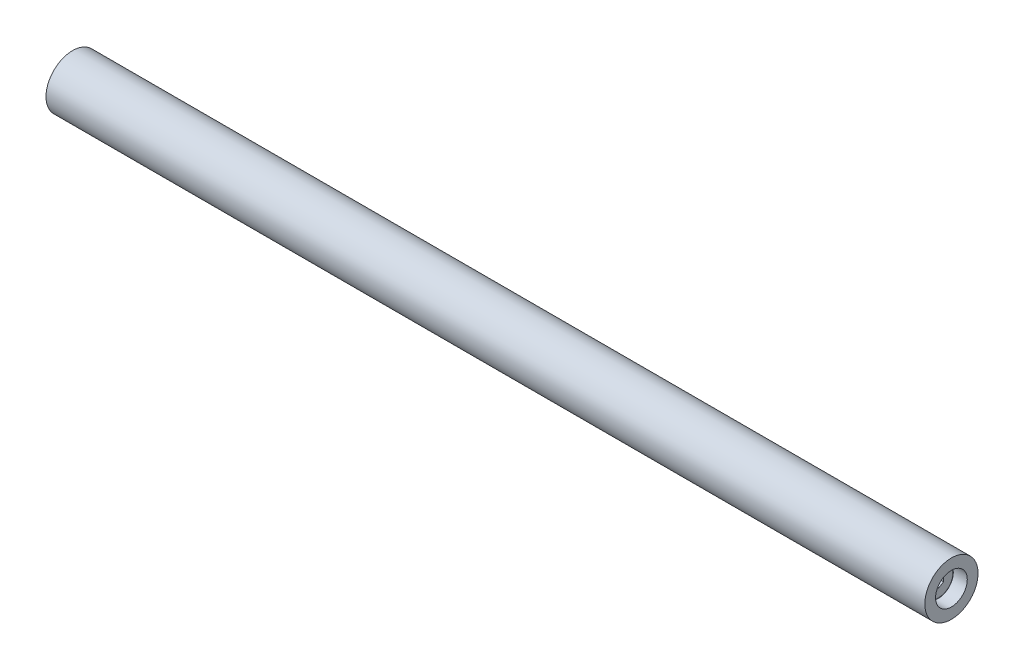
ISO-10303-21;
HEADER;
FILE_DESCRIPTION(('STEP AP214'),'2;1');
FILE_NAME('part.step','',(''),(''),'','','');
FILE_SCHEMA(('AUTOMOTIVE_DESIGN { 1 0 10303 214 1 1 1 1 }'));
ENDSEC;
DATA;
#1=APPLICATION_CONTEXT('core data for automotive mechanical design processes');
#2=APPLICATION_PROTOCOL_DEFINITION('international standard','automotive_design',2000,#1);
#3=PRODUCT_CONTEXT('',#1,'mechanical');
#4=PRODUCT('Part','Part','',(#3));
#5=PRODUCT_RELATED_PRODUCT_CATEGORY('part','',(#4));
#6=PRODUCT_DEFINITION_FORMATION('','',#4);
#7=PRODUCT_DEFINITION_CONTEXT('part definition',#1,'design');
#8=PRODUCT_DEFINITION('design','',#6,#7);
#9=PRODUCT_DEFINITION_SHAPE('','',#8);
#10=(LENGTH_UNIT() NAMED_UNIT(*) SI_UNIT(.MILLI.,.METRE.));
#11=(NAMED_UNIT(*) PLANE_ANGLE_UNIT() SI_UNIT($,.RADIAN.));
#12=(NAMED_UNIT(*) SI_UNIT($,.STERADIAN.) SOLID_ANGLE_UNIT());
#13=UNCERTAINTY_MEASURE_WITH_UNIT(LENGTH_MEASURE(1.E-05),#10,'distance_accuracy_value','');
#14=(GEOMETRIC_REPRESENTATION_CONTEXT(3) GLOBAL_UNCERTAINTY_ASSIGNED_CONTEXT((#13)) GLOBAL_UNIT_ASSIGNED_CONTEXT((#10,
#11,#12)) REPRESENTATION_CONTEXT('',''));
#15=CARTESIAN_POINT('',(0.,0.,0.));
#16=DIRECTION('',(0.,0.,1.));
#17=DIRECTION('',(1.,0.,0.));
#18=AXIS2_PLACEMENT_3D('',#15,#16,#17);
#19=CARTESIAN_POINT('',(4.7625,0.,0.));
#20=DIRECTION('',(1.,0.,0.));
#21=DIRECTION('',(0.,0.,-1.));
#22=AXIS2_PLACEMENT_3D('',#19,#20,#21);
#23=PLANE('',#22);
#24=CARTESIAN_POINT('',(4.7625,0.,0.));
#25=DIRECTION('',(-1.,0.,0.));
#26=DIRECTION('',(0.,0.,1.));
#27=AXIS2_PLACEMENT_3D('',#24,#25,#26);
#28=CIRCLE('',#27,5.2578);
#29=CARTESIAN_POINT('',(4.7625,0.,5.2578));
#30=VERTEX_POINT('',#29);
#31=EDGE_CURVE('E207',#30,#30,#28,.T.);
#32=ORIENTED_EDGE('',*,*,#31,.T.);
#33=EDGE_LOOP('',(#32));
#34=FACE_BOUND('',#33,.T.);
#35=DIRECTION('',(0.,-0.5,0.866025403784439));
#36=VECTOR('',#35,1.);
#37=CARTESIAN_POINT('',(4.7625,2.11904869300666,0.));
#38=LINE('',#37,#36);
#39=CARTESIAN_POINT('',(4.7625,2.11904869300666,0.));
#40=VERTEX_POINT('',#39);
#41=CARTESIAN_POINT('',(4.7625,1.0595243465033,1.83515));
#42=VERTEX_POINT('',#41);
#43=EDGE_CURVE('E48',#40,#42,#38,.T.);
#44=ORIENTED_EDGE('',*,*,#43,.T.);
#45=DIRECTION('',(0.,-1.,0.));
#46=VECTOR('',#45,1.);
#47=CARTESIAN_POINT('',(4.7625,1.0595243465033,1.83515));
#48=LINE('',#47,#46);
#49=CARTESIAN_POINT('',(4.7625,-1.0595243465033,1.83515));
#50=VERTEX_POINT('',#49);
#51=EDGE_CURVE('E142',#42,#50,#48,.T.);
#52=ORIENTED_EDGE('',*,*,#51,.T.);
#53=DIRECTION('',(0.,-0.5,-0.866025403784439));
#54=VECTOR('',#53,1.);
#55=CARTESIAN_POINT('',(4.7625,-1.0595243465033,1.83515));
#56=LINE('',#55,#54);
#57=CARTESIAN_POINT('',(4.7625,-2.11904869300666,0.));
#58=VERTEX_POINT('',#57);
#59=EDGE_CURVE('E507',#50,#58,#56,.T.);
#60=ORIENTED_EDGE('',*,*,#59,.T.);
#61=DIRECTION('',(0.,0.5,-0.866025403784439));
#62=VECTOR('',#61,1.);
#63=CARTESIAN_POINT('',(4.7625,-2.11904869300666,0.));
#64=LINE('',#63,#62);
#65=CARTESIAN_POINT('',(4.7625,-1.0595243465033,-1.83515000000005));
#66=VERTEX_POINT('',#65);
#67=EDGE_CURVE('E504',#58,#66,#64,.T.);
#68=ORIENTED_EDGE('',*,*,#67,.T.);
#69=DIRECTION('',(0.,1.,0.));
#70=VECTOR('',#69,1.);
#71=CARTESIAN_POINT('',(4.7625,-1.0595243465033,-1.83515000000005));
#72=LINE('',#71,#70);
#73=CARTESIAN_POINT('',(4.7625,1.0595243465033,-1.83515000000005));
#74=VERTEX_POINT('',#73);
#75=EDGE_CURVE('E498',#66,#74,#72,.T.);
#76=ORIENTED_EDGE('',*,*,#75,.T.);
#77=DIRECTION('',(0.,0.5,0.866025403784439));
#78=VECTOR('',#77,1.);
#79=CARTESIAN_POINT('',(4.7625,1.0595243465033,-1.83515000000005));
#80=LINE('',#79,#78);
#81=EDGE_CURVE('E138',#74,#40,#80,.T.);
#82=ORIENTED_EDGE('',*,*,#81,.T.);
#83=EDGE_LOOP('',(#44,#52,#60,#68,#76,#82));
#84=FACE_BOUND('',#83,.T.);
#85=ADVANCED_FACE('F33',(#34,#84),#23,.F.);
#86=CARTESIAN_POINT('',(320.675,0.,0.));
#87=DIRECTION('',(1.,0.,0.));
#88=DIRECTION('',(0.,0.,-1.));
#89=AXIS2_PLACEMENT_3D('',#86,#87,#88);
#90=PLANE('',#89);
#91=CARTESIAN_POINT('',(320.675,0.,0.));
#92=DIRECTION('',(1.,0.,0.));
#93=DIRECTION('',(0.,0.,-1.));
#94=AXIS2_PLACEMENT_3D('',#91,#92,#93);
#95=CIRCLE('',#94,5.9563);
#96=CARTESIAN_POINT('',(320.675,0.,-5.9563));
#97=VERTEX_POINT('',#96);
#98=EDGE_CURVE('E217',#97,#97,#95,.T.);
#99=ORIENTED_EDGE('',*,*,#98,.T.);
#100=EDGE_LOOP('',(#99));
#101=FACE_BOUND('',#100,.T.);
#102=CARTESIAN_POINT('',(320.675,0.,0.));
#103=DIRECTION('',(-1.,0.,0.));
#104=DIRECTION('',(0.,0.,1.));
#105=AXIS2_PLACEMENT_3D('',#102,#103,#104);
#106=CIRCLE('',#105,5.7658);
#107=CARTESIAN_POINT('',(320.675,0.,5.7658));
#108=VERTEX_POINT('',#107);
#109=EDGE_CURVE('E201',#108,#108,#106,.T.);
#110=ORIENTED_EDGE('',*,*,#109,.T.);
#111=EDGE_LOOP('',(#110));
#112=FACE_BOUND('',#111,.T.);
#113=ADVANCED_FACE('F247',(#101,#112),#90,.T.);
#114=CARTESIAN_POINT('',(9.525,0.,0.));
#115=DIRECTION('',(1.,0.,0.));
#116=DIRECTION('',(0.,0.,-1.));
#117=AXIS2_PLACEMENT_3D('',#114,#115,#116);
#118=PLANE('',#117);
#119=CARTESIAN_POINT('',(9.525,0.,0.));
#120=DIRECTION('',(1.,0.,0.));
#121=DIRECTION('',(0.,0.,-1.));
#122=AXIS2_PLACEMENT_3D('',#119,#120,#121);
#123=CIRCLE('',#122,5.9563);
#124=CARTESIAN_POINT('',(9.525,0.,5.9563));
#125=VERTEX_POINT('',#124);
#126=EDGE_CURVE('E211',#125,#125,#123,.T.);
#127=ORIENTED_EDGE('',*,*,#126,.F.);
#128=EDGE_LOOP('',(#127));
#129=FACE_BOUND('',#128,.T.);
#130=CARTESIAN_POINT('',(9.525,0.,0.));
#131=DIRECTION('',(1.,0.,0.));
#132=DIRECTION('',(0.,0.,-1.));
#133=AXIS2_PLACEMENT_3D('',#130,#131,#132);
#134=CIRCLE('',#133,5.7658);
#135=CARTESIAN_POINT('',(9.525,0.,-5.7658));
#136=VERTEX_POINT('',#135);
#137=EDGE_CURVE('E11',#136,#136,#134,.F.);
#138=ORIENTED_EDGE('',*,*,#137,.F.);
#139=EDGE_LOOP('',(#138));
#140=FACE_BOUND('',#139,.T.);
#141=ADVANCED_FACE('F253',(#129,#140),#118,.F.);
#142=CARTESIAN_POINT('',(0.,0.,0.));
#143=DIRECTION('',(1.,0.,0.));
#144=DIRECTION('',(0.,0.,-1.));
#145=AXIS2_PLACEMENT_3D('',#142,#143,#144);
#146=PLANE('',#145);
#147=CARTESIAN_POINT('',(0.,0.,0.));
#148=DIRECTION('',(-1.,0.,0.));
#149=DIRECTION('',(0.,0.,1.));
#150=AXIS2_PLACEMENT_3D('',#147,#148,#149);
#151=CIRCLE('',#150,10.0076);
#152=CARTESIAN_POINT('',(0.,0.,10.0076));
#153=VERTEX_POINT('',#152);
#154=EDGE_CURVE('E41',#153,#153,#151,.T.);
#155=ORIENTED_EDGE('',*,*,#154,.T.);
#156=EDGE_LOOP('',(#155));
#157=FACE_BOUND('',#156,.T.);
#158=CARTESIAN_POINT('',(0.,0.,0.));
#159=DIRECTION('',(1.,0.,0.));
#160=DIRECTION('',(0.,0.,-1.));
#161=AXIS2_PLACEMENT_3D('',#158,#159,#160);
#162=CIRCLE('',#161,5.9563);
#163=CARTESIAN_POINT('',(0.,0.,5.9563));
#164=VERTEX_POINT('',#163);
#165=EDGE_CURVE('E210',#164,#164,#162,.T.);
#166=ORIENTED_EDGE('',*,*,#165,.T.);
#167=EDGE_LOOP('',(#166));
#168=FACE_BOUND('',#167,.T.);
#169=ADVANCED_FACE('F35',(#157,#168),#146,.F.);
#170=CARTESIAN_POINT('',(330.2,0.,0.));
#171=DIRECTION('',(-1.,0.,0.));
#172=DIRECTION('',(0.,0.,1.));
#173=AXIS2_PLACEMENT_3D('',#170,#171,#172);
#174=CYLINDRICAL_SURFACE('',#173,10.0076);
#175=ORIENTED_EDGE('',*,*,#154,.F.);
#176=EDGE_LOOP('',(#175));
#177=FACE_BOUND('',#176,.T.);
#178=CARTESIAN_POINT('',(330.2,0.,0.));
#179=DIRECTION('',(-1.,0.,0.));
#180=DIRECTION('',(0.,0.,1.));
#181=AXIS2_PLACEMENT_3D('',#178,#179,#180);
#182=CIRCLE('',#181,10.0076);
#183=CARTESIAN_POINT('',(330.2,0.,10.0076));
#184=VERTEX_POINT('',#183);
#185=EDGE_CURVE('E220',#184,#184,#182,.T.);
#186=ORIENTED_EDGE('',*,*,#185,.T.);
#187=EDGE_LOOP('',(#186));
#188=FACE_BOUND('',#187,.T.);
#189=ADVANCED_FACE('F229',(#177,#188),#174,.T.);
#190=CARTESIAN_POINT('',(330.2,10.0076,0.));
#191=DIRECTION('',(-1.,0.,0.));
#192=DIRECTION('',(0.,0.,1.));
#193=AXIS2_PLACEMENT_3D('',#190,#191,#192);
#194=PLANE('',#193);
#195=CARTESIAN_POINT('',(330.2,0.,0.));
#196=DIRECTION('',(1.,0.,0.));
#197=DIRECTION('',(0.,0.,-1.));
#198=AXIS2_PLACEMENT_3D('',#195,#196,#197);
#199=CIRCLE('',#198,5.9563);
#200=CARTESIAN_POINT('',(330.2,0.,-5.9563));
#201=VERTEX_POINT('',#200);
#202=EDGE_CURVE('E214',#201,#201,#199,.T.);
#203=ORIENTED_EDGE('',*,*,#202,.F.);
#204=EDGE_LOOP('',(#203));
#205=FACE_BOUND('',#204,.T.);
#206=ORIENTED_EDGE('',*,*,#185,.F.);
#207=EDGE_LOOP('',(#206));
#208=FACE_BOUND('',#207,.T.);
#209=ADVANCED_FACE('F232',(#205,#208),#194,.F.);
#210=CARTESIAN_POINT('',(320.675,0.,0.));
#211=DIRECTION('',(1.,0.,0.));
#212=DIRECTION('',(0.,0.,-1.));
#213=AXIS2_PLACEMENT_3D('',#210,#211,#212);
#214=CYLINDRICAL_SURFACE('',#213,5.9563);
#215=CARTESIAN_POINT('',(320.675,0.,-5.9563));
#216=CARTESIAN_POINT('',(320.77421875,0.,-5.9563));
#217=CARTESIAN_POINT('',(320.8734375,0.,-5.9563));
#218=CARTESIAN_POINT('',(321.071875,0.,-5.9563));
#219=CARTESIAN_POINT('',(321.17109375,0.,-5.9563));
#220=CARTESIAN_POINT('',(321.36953125,0.,-5.9563));
#221=CARTESIAN_POINT('',(321.46875,0.,-5.9563));
#222=CARTESIAN_POINT('',(321.6671875,0.,-5.9563));
#223=CARTESIAN_POINT('',(321.76640625,0.,-5.9563));
#224=CARTESIAN_POINT('',(321.96484375,0.,-5.9563));
#225=CARTESIAN_POINT('',(322.0640625,0.,-5.9563));
#226=CARTESIAN_POINT('',(322.2625,0.,-5.9563));
#227=CARTESIAN_POINT('',(322.36171875,0.,-5.9563));
#228=CARTESIAN_POINT('',(322.56015625,0.,-5.9563));
#229=CARTESIAN_POINT('',(322.659375,0.,-5.9563));
#230=CARTESIAN_POINT('',(322.8578125,0.,-5.9563));
#231=CARTESIAN_POINT('',(322.95703125,0.,-5.9563));
#232=CARTESIAN_POINT('',(323.15546875,0.,-5.9563));
#233=CARTESIAN_POINT('',(323.2546875,0.,-5.9563));
#234=CARTESIAN_POINT('',(323.453125,0.,-5.9563));
#235=CARTESIAN_POINT('',(323.55234375,0.,-5.9563));
#236=CARTESIAN_POINT('',(323.75078125,0.,-5.9563));
#237=CARTESIAN_POINT('',(323.85,0.,-5.9563));
#238=CARTESIAN_POINT('',(324.0484375,0.,-5.9563));
#239=CARTESIAN_POINT('',(324.14765625,0.,-5.9563));
#240=CARTESIAN_POINT('',(324.34609375,0.,-5.9563));
#241=CARTESIAN_POINT('',(324.4453125,0.,-5.9563));
#242=CARTESIAN_POINT('',(324.64375,0.,-5.9563));
#243=CARTESIAN_POINT('',(324.74296875,0.,-5.9563));
#244=CARTESIAN_POINT('',(324.94140625,0.,-5.9563));
#245=CARTESIAN_POINT('',(325.040625,0.,-5.9563));
#246=CARTESIAN_POINT('',(325.2390625,0.,-5.9563));
#247=CARTESIAN_POINT('',(325.33828125,0.,-5.9563));
#248=CARTESIAN_POINT('',(325.53671875,0.,-5.9563));
#249=CARTESIAN_POINT('',(325.6359375,0.,-5.9563));
#250=CARTESIAN_POINT('',(325.834375,0.,-5.9563));
#251=CARTESIAN_POINT('',(325.93359375,0.,-5.9563));
#252=CARTESIAN_POINT('',(326.13203125,0.,-5.9563));
#253=CARTESIAN_POINT('',(326.23125,0.,-5.9563));
#254=CARTESIAN_POINT('',(326.4296875,0.,-5.9563));
#255=CARTESIAN_POINT('',(326.52890625,0.,-5.9563));
#256=CARTESIAN_POINT('',(326.72734375,0.,-5.9563));
#257=CARTESIAN_POINT('',(326.8265625,0.,-5.9563));
#258=CARTESIAN_POINT('',(327.025,0.,-5.9563));
#259=CARTESIAN_POINT('',(327.12421875,0.,-5.9563));
#260=CARTESIAN_POINT('',(327.32265625,0.,-5.9563));
#261=CARTESIAN_POINT('',(327.421875,0.,-5.9563));
#262=CARTESIAN_POINT('',(327.6203125,0.,-5.9563));
#263=CARTESIAN_POINT('',(327.71953125,0.,-5.9563));
#264=CARTESIAN_POINT('',(327.91796875,0.,-5.9563));
#265=CARTESIAN_POINT('',(328.0171875,0.,-5.9563));
#266=CARTESIAN_POINT('',(328.215625,0.,-5.9563));
#267=CARTESIAN_POINT('',(328.31484375,0.,-5.9563));
#268=CARTESIAN_POINT('',(328.51328125,0.,-5.9563));
#269=CARTESIAN_POINT('',(328.6125,0.,-5.9563));
#270=CARTESIAN_POINT('',(328.8109375,0.,-5.9563));
#271=CARTESIAN_POINT('',(328.91015625,0.,-5.9563));
#272=CARTESIAN_POINT('',(329.10859375,0.,-5.9563));
#273=CARTESIAN_POINT('',(329.2078125,0.,-5.9563));
#274=CARTESIAN_POINT('',(329.40625,0.,-5.9563));
#275=CARTESIAN_POINT('',(329.50546875,0.,-5.9563));
#276=CARTESIAN_POINT('',(329.70390625,0.,-5.9563));
#277=CARTESIAN_POINT('',(329.803125,0.,-5.9563));
#278=CARTESIAN_POINT('',(330.0015625,0.,-5.9563));
#279=CARTESIAN_POINT('',(330.10078125,0.,-5.9563));
#280=CARTESIAN_POINT('',(330.2,0.,-5.9563));
#281=B_SPLINE_CURVE_WITH_KNOTS('',3,(#215,#216,#217,#218,#219,#220,#221,#222,#223,#224,#225,
#226,#227,#228,#229,#230,#231,#232,#233,#234,#235,#236,#237,#238,#239,#240,#241,#242,#243,#244,
#245,#246,#247,#248,#249,#250,#251,#252,#253,#254,#255,#256,#257,#258,#259,#260,#261,#262,#263,
#264,#265,#266,#267,#268,#269,#270,#271,#272,#273,#274,#275,#276,#277,#278,#279,#280),
.UNSPECIFIED.,.F.,.F.,(4,2,2,2,2,2,2,2,2,2,2,2,2,2,2,2,2,2,2,2,2,2,2,2,2,2,2,2,2,2,2,2,4),(0.,
0.297656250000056,0.595312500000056,0.892968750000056,1.19062500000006,1.48828125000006,
1.78593750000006,2.08359375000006,2.38125000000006,2.67890625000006,2.97656250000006,
3.27421875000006,3.57187500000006,3.86953125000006,4.16718750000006,4.46484375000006,
4.76250000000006,5.06015625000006,5.35781250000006,5.65546875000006,5.95312500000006,
6.25078125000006,6.54843750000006,6.84609375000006,7.14375000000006,7.44140625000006,
7.73906250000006,8.03671875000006,8.33437500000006,8.63203125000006,8.92968750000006,
9.22734375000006,9.52500000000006),.UNSPECIFIED.);
#282=EDGE_CURVE('BSEAM236',#97,#201,#281,.T.);
#283=ORIENTED_EDGE('',*,*,#98,.F.);
#284=ORIENTED_EDGE('',*,*,#202,.T.);
#285=ORIENTED_EDGE('',*,*,#282,.T.);
#286=ORIENTED_EDGE('',*,*,#282,.F.);
#287=EDGE_LOOP('',(#283,#285,#284,#286));
#288=FACE_BOUND('',#287,.T.);
#289=ADVANCED_FACE('F236',(#288),#214,.F.);
#290=CARTESIAN_POINT('',(9.525,0.,0.));
#291=DIRECTION('',(-1.,0.,0.));
#292=DIRECTION('',(0.,0.,1.));
#293=AXIS2_PLACEMENT_3D('',#290,#291,#292);
#294=CYLINDRICAL_SURFACE('',#293,5.9563);
#295=CARTESIAN_POINT('',(9.525,0.,5.9563));
#296=CARTESIAN_POINT('',(9.42578125,0.,5.9563));
#297=CARTESIAN_POINT('',(9.3265625,0.,5.9563));
#298=CARTESIAN_POINT('',(9.128125,0.,5.9563));
#299=CARTESIAN_POINT('',(9.02890625,0.,5.9563));
#300=CARTESIAN_POINT('',(8.83046875,0.,5.9563));
#301=CARTESIAN_POINT('',(8.73125,0.,5.9563));
#302=CARTESIAN_POINT('',(8.5328125,0.,5.9563));
#303=CARTESIAN_POINT('',(8.43359375,0.,5.9563));
#304=CARTESIAN_POINT('',(8.23515625,0.,5.9563));
#305=CARTESIAN_POINT('',(8.1359375,0.,5.9563));
#306=CARTESIAN_POINT('',(7.9375,0.,5.9563));
#307=CARTESIAN_POINT('',(7.83828125,0.,5.9563));
#308=CARTESIAN_POINT('',(7.63984375,0.,5.9563));
#309=CARTESIAN_POINT('',(7.540625,0.,5.9563));
#310=CARTESIAN_POINT('',(7.3421875,0.,5.9563));
#311=CARTESIAN_POINT('',(7.24296875,0.,5.9563));
#312=CARTESIAN_POINT('',(7.04453125,0.,5.9563));
#313=CARTESIAN_POINT('',(6.9453125,0.,5.9563));
#314=CARTESIAN_POINT('',(6.746875,0.,5.9563));
#315=CARTESIAN_POINT('',(6.64765625,0.,5.9563));
#316=CARTESIAN_POINT('',(6.44921875,0.,5.9563));
#317=CARTESIAN_POINT('',(6.35,0.,5.9563));
#318=CARTESIAN_POINT('',(6.1515625,0.,5.9563));
#319=CARTESIAN_POINT('',(6.05234375,0.,5.9563));
#320=CARTESIAN_POINT('',(5.85390625,0.,5.9563));
#321=CARTESIAN_POINT('',(5.7546875,0.,5.9563));
#322=CARTESIAN_POINT('',(5.55625,0.,5.9563));
#323=CARTESIAN_POINT('',(5.45703125,0.,5.9563));
#324=CARTESIAN_POINT('',(5.25859375,0.,5.9563));
#325=CARTESIAN_POINT('',(5.159375,0.,5.9563));
#326=CARTESIAN_POINT('',(4.9609375,0.,5.9563));
#327=CARTESIAN_POINT('',(4.86171875,0.,5.9563));
#328=CARTESIAN_POINT('',(4.66328125,0.,5.9563));
#329=CARTESIAN_POINT('',(4.5640625,0.,5.9563));
#330=CARTESIAN_POINT('',(4.365625,0.,5.9563));
#331=CARTESIAN_POINT('',(4.26640625,0.,5.9563));
#332=CARTESIAN_POINT('',(4.06796875,0.,5.9563));
#333=CARTESIAN_POINT('',(3.96875,0.,5.9563));
#334=CARTESIAN_POINT('',(3.7703125,0.,5.9563));
#335=CARTESIAN_POINT('',(3.67109375,0.,5.9563));
#336=CARTESIAN_POINT('',(3.47265625,0.,5.9563));
#337=CARTESIAN_POINT('',(3.3734375,0.,5.9563));
#338=CARTESIAN_POINT('',(3.175,0.,5.9563));
#339=CARTESIAN_POINT('',(3.07578125,0.,5.9563));
#340=CARTESIAN_POINT('',(2.87734375,0.,5.9563));
#341=CARTESIAN_POINT('',(2.778125,0.,5.9563));
#342=CARTESIAN_POINT('',(2.5796875,0.,5.9563));
#343=CARTESIAN_POINT('',(2.48046875,0.,5.9563));
#344=CARTESIAN_POINT('',(2.28203125,0.,5.9563));
#345=CARTESIAN_POINT('',(2.1828125,0.,5.9563));
#346=CARTESIAN_POINT('',(1.984375,0.,5.9563));
#347=CARTESIAN_POINT('',(1.88515625,0.,5.9563));
#348=CARTESIAN_POINT('',(1.68671875,0.,5.9563));
#349=CARTESIAN_POINT('',(1.5875,0.,5.9563));
#350=CARTESIAN_POINT('',(1.3890625,0.,5.9563));
#351=CARTESIAN_POINT('',(1.28984375,0.,5.9563));
#352=CARTESIAN_POINT('',(1.09140625,0.,5.9563));
#353=CARTESIAN_POINT('',(0.992187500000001,0.,5.9563));
#354=CARTESIAN_POINT('',(0.793750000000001,0.,5.9563));
#355=CARTESIAN_POINT('',(0.69453125,0.,5.9563));
#356=CARTESIAN_POINT('',(0.49609375,0.,5.9563));
#357=CARTESIAN_POINT('',(0.396875,0.,5.9563));
#358=CARTESIAN_POINT('',(0.1984375,0.,5.9563));
#359=CARTESIAN_POINT('',(0.0992187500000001,0.,5.9563));
#360=CARTESIAN_POINT('',(0.,0.,5.9563));
#361=B_SPLINE_CURVE_WITH_KNOTS('',3,(#295,#296,#297,#298,#299,#300,#301,#302,#303,#304,#305,
#306,#307,#308,#309,#310,#311,#312,#313,#314,#315,#316,#317,#318,#319,#320,#321,#322,#323,#324,
#325,#326,#327,#328,#329,#330,#331,#332,#333,#334,#335,#336,#337,#338,#339,#340,#341,#342,#343,
#344,#345,#346,#347,#348,#349,#350,#351,#352,#353,#354,#355,#356,#357,#358,#359,#360),
.UNSPECIFIED.,.F.,.F.,(4,2,2,2,2,2,2,2,2,2,2,2,2,2,2,2,2,2,2,2,2,2,2,2,2,2,2,2,2,2,2,2,4),(0.,
0.29765625,0.5953125,0.892968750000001,1.190625,1.48828125,1.7859375,2.08359375,2.38125,
2.67890625,2.9765625,3.27421875,3.571875,3.86953125,4.1671875,4.46484375,4.7625,5.06015625,
5.3578125,5.65546875,5.953125,6.25078125,6.5484375,6.84609375,7.14375,7.44140625,7.7390625,
8.03671875,8.334375,8.63203125,8.9296875,9.22734375,9.525),.UNSPECIFIED.);
#362=EDGE_CURVE('BSEAM242',#125,#164,#361,.T.);
#363=ORIENTED_EDGE('',*,*,#126,.T.);
#364=ORIENTED_EDGE('',*,*,#165,.F.);
#365=ORIENTED_EDGE('',*,*,#362,.T.);
#366=ORIENTED_EDGE('',*,*,#362,.F.);
#367=EDGE_LOOP('',(#363,#365,#364,#366));
#368=FACE_BOUND('',#367,.T.);
#369=ADVANCED_FACE('F242',(#368),#294,.F.);
#370=CARTESIAN_POINT('',(5.27049999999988,0.,0.));
#371=DIRECTION('',(-1.,0.,0.));
#372=DIRECTION('',(0.,0.,1.));
#373=AXIS2_PLACEMENT_3D('',#370,#371,#372);
#374=TOROIDAL_SURFACE('',#373,5.25780000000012,0.507999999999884);
#375=ORIENTED_EDGE('',*,*,#31,.F.);
#376=EDGE_LOOP('',(#375));
#377=FACE_BOUND('',#376,.T.);
#378=CARTESIAN_POINT('',(5.2705,0.,0.));
#379=DIRECTION('',(-1.,0.,0.));
#380=DIRECTION('',(0.,0.,1.));
#381=AXIS2_PLACEMENT_3D('',#378,#379,#380);
#382=CIRCLE('',#381,5.7658);
#383=CARTESIAN_POINT('',(5.2705,0.,5.7658));
#384=VERTEX_POINT('',#383);
#385=EDGE_CURVE('E204',#384,#384,#382,.T.);
#386=ORIENTED_EDGE('',*,*,#385,.T.);
#387=EDGE_LOOP('',(#386));
#388=FACE_BOUND('',#387,.T.);
#389=ADVANCED_FACE('F259',(#377,#388),#374,.T.);
#390=CARTESIAN_POINT('',(9.525,0.,0.));
#391=DIRECTION('',(-1.,0.,0.));
#392=DIRECTION('',(0.,0.,1.));
#393=AXIS2_PLACEMENT_3D('',#390,#391,#392);
#394=CYLINDRICAL_SURFACE('',#393,5.7658);
#395=ORIENTED_EDGE('',*,*,#385,.F.);
#396=EDGE_LOOP('',(#395));
#397=FACE_BOUND('',#396,.T.);
#398=ORIENTED_EDGE('',*,*,#137,.T.);
#399=EDGE_LOOP('',(#398));
#400=FACE_BOUND('',#399,.T.);
#401=ADVANCED_FACE('F269',(#397,#400),#394,.T.);
#402=CARTESIAN_POINT('',(325.4375,0.,0.));
#403=DIRECTION('',(-1.,0.,0.));
#404=DIRECTION('',(0.,0.,1.));
#405=AXIS2_PLACEMENT_3D('',#402,#403,#404);
#406=CYLINDRICAL_SURFACE('',#405,5.7658);
#407=ORIENTED_EDGE('',*,*,#109,.F.);
#408=EDGE_LOOP('',(#407));
#409=FACE_BOUND('',#408,.T.);
#410=CARTESIAN_POINT('',(324.9295,0.,0.));
#411=DIRECTION('',(-1.,0.,0.));
#412=DIRECTION('',(0.,0.,1.));
#413=AXIS2_PLACEMENT_3D('',#410,#411,#412);
#414=CIRCLE('',#413,5.7658);
#415=CARTESIAN_POINT('',(324.9295,0.,5.7658));
#416=VERTEX_POINT('',#415);
#417=EDGE_CURVE('E198',#416,#416,#414,.T.);
#418=ORIENTED_EDGE('',*,*,#417,.T.);
#419=EDGE_LOOP('',(#418));
#420=FACE_BOUND('',#419,.T.);
#421=ADVANCED_FACE('F318',(#409,#420),#406,.T.);
#422=CARTESIAN_POINT('',(324.929499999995,0.,0.));
#423=DIRECTION('',(-1.,0.,0.));
#424=DIRECTION('',(0.,0.,1.));
#425=AXIS2_PLACEMENT_3D('',#422,#423,#424);
#426=TOROIDAL_SURFACE('',#425,5.25779999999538,0.508000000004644);
#427=ORIENTED_EDGE('',*,*,#417,.F.);
#428=EDGE_LOOP('',(#427));
#429=FACE_BOUND('',#428,.T.);
#430=CARTESIAN_POINT('',(325.4375,0.,0.));
#431=DIRECTION('',(-1.,0.,0.));
#432=DIRECTION('',(0.,0.,1.));
#433=AXIS2_PLACEMENT_3D('',#430,#431,#432);
#434=CIRCLE('',#433,5.2578);
#435=CARTESIAN_POINT('',(325.4375,0.,5.2578));
#436=VERTEX_POINT('',#435);
#437=EDGE_CURVE('E186',#436,#436,#434,.T.);
#438=ORIENTED_EDGE('',*,*,#437,.T.);
#439=EDGE_LOOP('',(#438));
#440=FACE_BOUND('',#439,.T.);
#441=ADVANCED_FACE('F331',(#429,#440),#426,.T.);
#442=CARTESIAN_POINT('',(325.4375,5.2578,0.));
#443=DIRECTION('',(-1.,0.,0.));
#444=DIRECTION('',(0.,0.,1.));
#445=AXIS2_PLACEMENT_3D('',#442,#443,#444);
#446=PLANE('',#445);
#447=DIRECTION('',(0.,-1.,0.));
#448=VECTOR('',#447,1.);
#449=CARTESIAN_POINT('',(325.4375,1.0595243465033,1.83515));
#450=LINE('',#449,#448);
#451=CARTESIAN_POINT('',(325.4375,1.0595243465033,1.83515));
#452=VERTEX_POINT('',#451);
#453=CARTESIAN_POINT('',(325.4375,-1.0595243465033,1.83515));
#454=VERTEX_POINT('',#453);
#455=EDGE_CURVE('E145',#452,#454,#450,.T.);
#456=ORIENTED_EDGE('',*,*,#455,.F.);
#457=DIRECTION('',(0.,-0.5,0.866025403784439));
#458=VECTOR('',#457,1.);
#459=CARTESIAN_POINT('',(325.4375,2.11904869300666,0.));
#460=LINE('',#459,#458);
#461=CARTESIAN_POINT('',(325.4375,2.11904869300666,0.));
#462=VERTEX_POINT('',#461);
#463=EDGE_CURVE('E56',#462,#452,#460,.T.);
#464=ORIENTED_EDGE('',*,*,#463,.F.);
#465=DIRECTION('',(0.,0.5,0.866025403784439));
#466=VECTOR('',#465,1.);
#467=CARTESIAN_POINT('',(325.4375,1.0595243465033,-1.83515000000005));
#468=LINE('',#467,#466);
#469=CARTESIAN_POINT('',(325.4375,1.0595243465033,-1.83515000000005));
#470=VERTEX_POINT('',#469);
#471=EDGE_CURVE('E155',#470,#462,#468,.T.);
#472=ORIENTED_EDGE('',*,*,#471,.F.);
#473=DIRECTION('',(0.,1.,0.));
#474=VECTOR('',#473,1.);
#475=CARTESIAN_POINT('',(325.4375,-1.0595243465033,-1.83515000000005));
#476=LINE('',#475,#474);
#477=CARTESIAN_POINT('',(325.4375,-1.0595243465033,-1.83515000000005));
#478=VERTEX_POINT('',#477);
#479=EDGE_CURVE('E179',#478,#470,#476,.T.);
#480=ORIENTED_EDGE('',*,*,#479,.F.);
#481=DIRECTION('',(0.,0.5,-0.866025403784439));
#482=VECTOR('',#481,1.);
#483=CARTESIAN_POINT('',(325.4375,-2.11904869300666,0.));
#484=LINE('',#483,#482);
#485=CARTESIAN_POINT('',(325.4375,-2.11904869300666,0.));
#486=VERTEX_POINT('',#485);
#487=EDGE_CURVE('E176',#486,#478,#484,.T.);
#488=ORIENTED_EDGE('',*,*,#487,.F.);
#489=DIRECTION('',(0.,-0.5,-0.866025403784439));
#490=VECTOR('',#489,1.);
#491=CARTESIAN_POINT('',(325.4375,-1.0595243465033,1.83515));
#492=LINE('',#491,#490);
#493=EDGE_CURVE('E173',#454,#486,#492,.T.);
#494=ORIENTED_EDGE('',*,*,#493,.F.);
#495=EDGE_LOOP('',(#456,#464,#472,#480,#488,#494));
#496=FACE_BOUND('',#495,.T.);
#497=ORIENTED_EDGE('',*,*,#437,.F.);
#498=EDGE_LOOP('',(#497));
#499=FACE_BOUND('',#498,.T.);
#500=ADVANCED_FACE('F340',(#496,#499),#446,.F.);
#501=CARTESIAN_POINT('',(323.05625,2.11904869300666,0.));
#502=DIRECTION('',(0.,0.866025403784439,0.5));
#503=DIRECTION('',(0.,-0.5,0.866025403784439));
#504=AXIS2_PLACEMENT_3D('',#501,#502,#503);
#505=PLANE('',#504);
#506=ORIENTED_EDGE('',*,*,#463,.T.);
#507=DIRECTION('',(1.,0.,0.));
#508=VECTOR('',#507,1.);
#509=CARTESIAN_POINT('',(323.05625,1.0595243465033,1.83515));
#510=LINE('',#509,#508);
#511=CARTESIAN_POINT('',(323.05625,1.0595243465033,1.83515));
#512=VERTEX_POINT('',#511);
#513=EDGE_CURVE('E169',#512,#452,#510,.T.);
#514=ORIENTED_EDGE('',*,*,#513,.F.);
#515=DIRECTION('',(0.,-0.5,0.866025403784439));
#516=VECTOR('',#515,1.);
#517=CARTESIAN_POINT('',(323.05625,2.11904869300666,0.));
#518=LINE('',#517,#516);
#519=CARTESIAN_POINT('',(323.05625,2.11904869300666,0.));
#520=VERTEX_POINT('',#519);
#521=EDGE_CURVE('E151',#520,#512,#518,.T.);
#522=ORIENTED_EDGE('',*,*,#521,.F.);
#523=DIRECTION('',(1.,0.,0.));
#524=VECTOR('',#523,1.);
#525=CARTESIAN_POINT('',(323.05625,2.11904869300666,0.));
#526=LINE('',#525,#524);
#527=EDGE_CURVE('E184',#520,#462,#526,.T.);
#528=ORIENTED_EDGE('',*,*,#527,.T.);
#529=EDGE_LOOP('',(#506,#514,#522,#528));
#530=FACE_BOUND('',#529,.T.);
#531=ADVANCED_FACE('F349',(#530),#505,.F.);
#532=CARTESIAN_POINT('',(323.05625,1.0595243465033,-1.83515000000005));
#533=DIRECTION('',(0.,0.866025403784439,-0.5));
#534=DIRECTION('',(0.,0.5,0.866025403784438));
#535=AXIS2_PLACEMENT_3D('',#532,#533,#534);
#536=PLANE('',#535);
#537=ORIENTED_EDGE('',*,*,#471,.T.);
#538=ORIENTED_EDGE('',*,*,#527,.F.);
#539=DIRECTION('',(0.,0.5,0.866025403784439));
#540=VECTOR('',#539,1.);
#541=CARTESIAN_POINT('',(323.05625,1.0595243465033,-1.83515000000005));
#542=LINE('',#541,#540);
#543=CARTESIAN_POINT('',(323.05625,1.0595243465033,-1.83515000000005));
#544=VERTEX_POINT('',#543);
#545=EDGE_CURVE('E167',#544,#520,#542,.T.);
#546=ORIENTED_EDGE('',*,*,#545,.F.);
#547=DIRECTION('',(1.,0.,0.));
#548=VECTOR('',#547,1.);
#549=CARTESIAN_POINT('',(323.05625,1.0595243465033,-1.83515000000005));
#550=LINE('',#549,#548);
#551=EDGE_CURVE('E187',#544,#470,#550,.T.);
#552=ORIENTED_EDGE('',*,*,#551,.T.);
#553=EDGE_LOOP('',(#537,#538,#546,#552));
#554=FACE_BOUND('',#553,.T.);
#555=ADVANCED_FACE('F358',(#554),#536,.F.);
#556=CARTESIAN_POINT('',(323.05625,-1.0595243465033,-1.83515000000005));
#557=DIRECTION('',(0.,0.,-1.));
#558=DIRECTION('',(-1.,0.,0.));
#559=AXIS2_PLACEMENT_3D('',#556,#557,#558);
#560=PLANE('',#559);
#561=ORIENTED_EDGE('',*,*,#479,.T.);
#562=ORIENTED_EDGE('',*,*,#551,.F.);
#563=DIRECTION('',(0.,1.,0.));
#564=VECTOR('',#563,1.);
#565=CARTESIAN_POINT('',(323.05625,-1.0595243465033,-1.83515000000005));
#566=LINE('',#565,#564);
#567=CARTESIAN_POINT('',(323.05625,-1.0595243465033,-1.83515000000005));
#568=VERTEX_POINT('',#567);
#569=EDGE_CURVE('E164',#568,#544,#566,.T.);
#570=ORIENTED_EDGE('',*,*,#569,.F.);
#571=DIRECTION('',(1.,0.,0.));
#572=VECTOR('',#571,1.);
#573=CARTESIAN_POINT('',(323.05625,-1.0595243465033,-1.83515000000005));
#574=LINE('',#573,#572);
#575=EDGE_CURVE('E189',#568,#478,#574,.T.);
#576=ORIENTED_EDGE('',*,*,#575,.T.);
#577=EDGE_LOOP('',(#561,#562,#570,#576));
#578=FACE_BOUND('',#577,.T.);
#579=ADVANCED_FACE('F366',(#578),#560,.F.);
#580=CARTESIAN_POINT('',(323.05625,-2.11904869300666,0.));
#581=DIRECTION('',(0.,-0.866025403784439,-0.5));
#582=DIRECTION('',(0.,0.5,-0.866025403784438));
#583=AXIS2_PLACEMENT_3D('',#580,#581,#582);
#584=PLANE('',#583);
#585=ORIENTED_EDGE('',*,*,#487,.T.);
#586=ORIENTED_EDGE('',*,*,#575,.F.);
#587=DIRECTION('',(0.,0.5,-0.866025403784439));
#588=VECTOR('',#587,1.);
#589=CARTESIAN_POINT('',(323.05625,-2.11904869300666,0.));
#590=LINE('',#589,#588);
#591=CARTESIAN_POINT('',(323.05625,-2.11904869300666,0.));
#592=VERTEX_POINT('',#591);
#593=EDGE_CURVE('E161',#592,#568,#590,.T.);
#594=ORIENTED_EDGE('',*,*,#593,.F.);
#595=DIRECTION('',(1.,0.,0.));
#596=VECTOR('',#595,1.);
#597=CARTESIAN_POINT('',(323.05625,-2.11904869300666,0.));
#598=LINE('',#597,#596);
#599=EDGE_CURVE('E191',#592,#486,#598,.T.);
#600=ORIENTED_EDGE('',*,*,#599,.T.);
#601=EDGE_LOOP('',(#585,#586,#594,#600));
#602=FACE_BOUND('',#601,.T.);
#603=ADVANCED_FACE('F375',(#602),#584,.F.);
#604=CARTESIAN_POINT('',(323.05625,-1.0595243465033,1.83515));
#605=DIRECTION('',(0.,-0.866025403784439,0.5));
#606=DIRECTION('',(0.,-0.5,-0.866025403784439));
#607=AXIS2_PLACEMENT_3D('',#604,#605,#606);
#608=PLANE('',#607);
#609=ORIENTED_EDGE('',*,*,#493,.T.);
#610=ORIENTED_EDGE('',*,*,#599,.F.);
#611=DIRECTION('',(0.,-0.5,-0.866025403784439));
#612=VECTOR('',#611,1.);
#613=CARTESIAN_POINT('',(323.05625,-1.0595243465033,1.83515));
#614=LINE('',#613,#612);
#615=CARTESIAN_POINT('',(323.05625,-1.0595243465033,1.83515));
#616=VERTEX_POINT('',#615);
#617=EDGE_CURVE('E158',#616,#592,#614,.T.);
#618=ORIENTED_EDGE('',*,*,#617,.F.);
#619=DIRECTION('',(1.,0.,0.));
#620=VECTOR('',#619,1.);
#621=CARTESIAN_POINT('',(323.05625,-1.0595243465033,1.83515));
#622=LINE('',#621,#620);
#623=EDGE_CURVE('E193',#616,#454,#622,.T.);
#624=ORIENTED_EDGE('',*,*,#623,.T.);
#625=EDGE_LOOP('',(#609,#610,#618,#624));
#626=FACE_BOUND('',#625,.T.);
#627=ADVANCED_FACE('F384',(#626),#608,.F.);
#628=CARTESIAN_POINT('',(323.05625,1.0595243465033,1.83515));
#629=DIRECTION('',(0.,0.,1.));
#630=DIRECTION('',(1.,0.,0.));
#631=AXIS2_PLACEMENT_3D('',#628,#629,#630);
#632=PLANE('',#631);
#633=ORIENTED_EDGE('',*,*,#455,.T.);
#634=ORIENTED_EDGE('',*,*,#623,.F.);
#635=DIRECTION('',(0.,-1.,0.));
#636=VECTOR('',#635,1.);
#637=CARTESIAN_POINT('',(323.05625,1.0595243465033,1.83515));
#638=LINE('',#637,#636);
#639=EDGE_CURVE('E154',#512,#616,#638,.T.);
#640=ORIENTED_EDGE('',*,*,#639,.F.);
#641=ORIENTED_EDGE('',*,*,#513,.T.);
#642=EDGE_LOOP('',(#633,#634,#640,#641));
#643=FACE_BOUND('',#642,.T.);
#644=ADVANCED_FACE('F393',(#643),#632,.F.);
#645=CARTESIAN_POINT('',(323.05625,2.11904869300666,0.));
#646=DIRECTION('',(-1.,0.,0.));
#647=DIRECTION('',(0.,0.,1.));
#648=AXIS2_PLACEMENT_3D('',#645,#646,#647);
#649=PLANE('',#648);
#650=ORIENTED_EDGE('',*,*,#521,.T.);
#651=ORIENTED_EDGE('',*,*,#639,.T.);
#652=ORIENTED_EDGE('',*,*,#617,.T.);
#653=ORIENTED_EDGE('',*,*,#593,.T.);
#654=ORIENTED_EDGE('',*,*,#569,.T.);
#655=ORIENTED_EDGE('',*,*,#545,.T.);
#656=EDGE_LOOP('',(#650,#651,#652,#653,#654,#655));
#657=FACE_BOUND('',#656,.T.);
#658=ADVANCED_FACE('F402',(#657),#649,.F.);
#659=CARTESIAN_POINT('',(7.14375,2.11904869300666,0.));
#660=DIRECTION('',(0.,-0.866025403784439,-0.5));
#661=DIRECTION('',(0.,0.5,-0.866025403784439));
#662=AXIS2_PLACEMENT_3D('',#659,#660,#661);
#663=PLANE('',#662);
#664=ORIENTED_EDGE('',*,*,#43,.F.);
#665=DIRECTION('',(-1.,0.,0.));
#666=VECTOR('',#665,1.);
#667=CARTESIAN_POINT('',(7.14375,2.11904869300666,0.));
#668=LINE('',#667,#666);
#669=CARTESIAN_POINT('',(7.14375,2.11904869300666,0.));
#670=VERTEX_POINT('',#669);
#671=EDGE_CURVE('E137',#670,#40,#668,.T.);
#672=ORIENTED_EDGE('',*,*,#671,.F.);
#673=DIRECTION('',(0.,-0.5,0.866025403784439));
#674=VECTOR('',#673,1.);
#675=CARTESIAN_POINT('',(7.14375,2.11904869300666,0.));
#676=LINE('',#675,#674);
#677=CARTESIAN_POINT('',(7.14375,1.0595243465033,1.83515));
#678=VERTEX_POINT('',#677);
#679=EDGE_CURVE('E128',#670,#678,#676,.T.);
#680=ORIENTED_EDGE('',*,*,#679,.T.);
#681=DIRECTION('',(-1.,0.,0.));
#682=VECTOR('',#681,1.);
#683=CARTESIAN_POINT('',(7.14375,1.0595243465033,1.83515));
#684=LINE('',#683,#682);
#685=EDGE_CURVE('E136',#678,#42,#684,.T.);
#686=ORIENTED_EDGE('',*,*,#685,.T.);
#687=EDGE_LOOP('',(#664,#672,#680,#686));
#688=FACE_BOUND('',#687,.T.);
#689=ADVANCED_FACE('F135',(#688),#663,.T.);
#690=CARTESIAN_POINT('',(7.14375,1.0595243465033,1.83515));
#691=DIRECTION('',(0.,0.,-1.));
#692=DIRECTION('',(-1.,0.,0.));
#693=AXIS2_PLACEMENT_3D('',#690,#691,#692);
#694=PLANE('',#693);
#695=ORIENTED_EDGE('',*,*,#51,.F.);
#696=ORIENTED_EDGE('',*,*,#685,.F.);
#697=DIRECTION('',(0.,-1.,0.));
#698=VECTOR('',#697,1.);
#699=CARTESIAN_POINT('',(7.14375,1.0595243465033,1.83515));
#700=LINE('',#699,#698);
#701=CARTESIAN_POINT('',(7.14375,-1.0595243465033,1.83515));
#702=VERTEX_POINT('',#701);
#703=EDGE_CURVE('E124',#678,#702,#700,.T.);
#704=ORIENTED_EDGE('',*,*,#703,.T.);
#705=DIRECTION('',(-1.,0.,0.));
#706=VECTOR('',#705,1.);
#707=CARTESIAN_POINT('',(7.14375,-1.0595243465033,1.83515));
#708=LINE('',#707,#706);
#709=EDGE_CURVE('E143',#702,#50,#708,.T.);
#710=ORIENTED_EDGE('',*,*,#709,.T.);
#711=EDGE_LOOP('',(#695,#696,#704,#710));
#712=FACE_BOUND('',#711,.T.);
#713=ADVANCED_FACE('F140',(#712),#694,.T.);
#714=CARTESIAN_POINT('',(7.14375,-1.0595243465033,1.83515));
#715=DIRECTION('',(0.,0.866025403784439,-0.5));
#716=DIRECTION('',(0.,0.5,0.866025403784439));
#717=AXIS2_PLACEMENT_3D('',#714,#715,#716);
#718=PLANE('',#717);
#719=ORIENTED_EDGE('',*,*,#59,.F.);
#720=ORIENTED_EDGE('',*,*,#709,.F.);
#721=DIRECTION('',(0.,-0.5,-0.866025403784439));
#722=VECTOR('',#721,1.);
#723=CARTESIAN_POINT('',(7.14375,-1.0595243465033,1.83515));
#724=LINE('',#723,#722);
#725=CARTESIAN_POINT('',(7.14375,-2.11904869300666,0.));
#726=VERTEX_POINT('',#725);
#727=EDGE_CURVE('E130',#702,#726,#724,.T.);
#728=ORIENTED_EDGE('',*,*,#727,.T.);
#729=DIRECTION('',(-1.,0.,0.));
#730=VECTOR('',#729,1.);
#731=CARTESIAN_POINT('',(7.14375,-2.11904869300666,0.));
#732=LINE('',#731,#730);
#733=EDGE_CURVE('E147',#726,#58,#732,.T.);
#734=ORIENTED_EDGE('',*,*,#733,.T.);
#735=EDGE_LOOP('',(#719,#720,#728,#734));
#736=FACE_BOUND('',#735,.T.);
#737=ADVANCED_FACE('F430',(#736),#718,.T.);
#738=CARTESIAN_POINT('',(7.14375,-2.11904869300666,0.));
#739=DIRECTION('',(0.,0.866025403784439,0.5));
#740=DIRECTION('',(0.,-0.5,0.866025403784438));
#741=AXIS2_PLACEMENT_3D('',#738,#739,#740);
#742=PLANE('',#741);
#743=ORIENTED_EDGE('',*,*,#67,.F.);
#744=ORIENTED_EDGE('',*,*,#733,.F.);
#745=DIRECTION('',(0.,0.5,-0.866025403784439));
#746=VECTOR('',#745,1.);
#747=CARTESIAN_POINT('',(7.14375,-2.11904869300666,0.));
#748=LINE('',#747,#746);
#749=CARTESIAN_POINT('',(7.14375,-1.0595243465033,-1.83515000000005));
#750=VERTEX_POINT('',#749);
#751=EDGE_CURVE('E523',#726,#750,#748,.T.);
#752=ORIENTED_EDGE('',*,*,#751,.T.);
#753=DIRECTION('',(-1.,0.,0.));
#754=VECTOR('',#753,1.);
#755=CARTESIAN_POINT('',(7.14375,-1.0595243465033,-1.83515000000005));
#756=LINE('',#755,#754);
#757=EDGE_CURVE('E514',#750,#66,#756,.T.);
#758=ORIENTED_EDGE('',*,*,#757,.T.);
#759=EDGE_LOOP('',(#743,#744,#752,#758));
#760=FACE_BOUND('',#759,.T.);
#761=ADVANCED_FACE('F438',(#760),#742,.T.);
#762=CARTESIAN_POINT('',(7.14375,-1.0595243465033,-1.83515000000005));
#763=DIRECTION('',(0.,0.,1.));
#764=DIRECTION('',(1.,0.,0.));
#765=AXIS2_PLACEMENT_3D('',#762,#763,#764);
#766=PLANE('',#765);
#767=ORIENTED_EDGE('',*,*,#75,.F.);
#768=ORIENTED_EDGE('',*,*,#757,.F.);
#769=DIRECTION('',(0.,1.,0.));
#770=VECTOR('',#769,1.);
#771=CARTESIAN_POINT('',(7.14375,-1.0595243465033,-1.83515000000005));
#772=LINE('',#771,#770);
#773=CARTESIAN_POINT('',(7.14375,1.0595243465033,-1.83515000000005));
#774=VERTEX_POINT('',#773);
#775=EDGE_CURVE('E521',#750,#774,#772,.T.);
#776=ORIENTED_EDGE('',*,*,#775,.T.);
#777=DIRECTION('',(-1.,0.,0.));
#778=VECTOR('',#777,1.);
#779=CARTESIAN_POINT('',(7.14375,1.0595243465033,-1.83515000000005));
#780=LINE('',#779,#778);
#781=EDGE_CURVE('E497',#774,#74,#780,.T.);
#782=ORIENTED_EDGE('',*,*,#781,.T.);
#783=EDGE_LOOP('',(#767,#768,#776,#782));
#784=FACE_BOUND('',#783,.T.);
#785=ADVANCED_FACE('F447',(#784),#766,.T.);
#786=CARTESIAN_POINT('',(7.14375,1.0595243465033,-1.83515000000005));
#787=DIRECTION('',(0.,-0.866025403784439,0.5));
#788=DIRECTION('',(0.,-0.5,-0.866025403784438));
#789=AXIS2_PLACEMENT_3D('',#786,#787,#788);
#790=PLANE('',#789);
#791=ORIENTED_EDGE('',*,*,#81,.F.);
#792=ORIENTED_EDGE('',*,*,#781,.F.);
#793=DIRECTION('',(0.,0.5,0.866025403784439));
#794=VECTOR('',#793,1.);
#795=CARTESIAN_POINT('',(7.14375,1.0595243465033,-1.83515000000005));
#796=LINE('',#795,#794);
#797=EDGE_CURVE('E512',#774,#670,#796,.T.);
#798=ORIENTED_EDGE('',*,*,#797,.T.);
#799=ORIENTED_EDGE('',*,*,#671,.T.);
#800=EDGE_LOOP('',(#791,#792,#798,#799));
#801=FACE_BOUND('',#800,.T.);
#802=ADVANCED_FACE('F456',(#801),#790,.T.);
#803=CARTESIAN_POINT('',(7.14375,2.11904869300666,0.));
#804=DIRECTION('',(-1.,0.,0.));
#805=DIRECTION('',(0.,0.,1.));
#806=AXIS2_PLACEMENT_3D('',#803,#804,#805);
#807=PLANE('',#806);
#808=ORIENTED_EDGE('',*,*,#679,.F.);
#809=ORIENTED_EDGE('',*,*,#797,.F.);
#810=ORIENTED_EDGE('',*,*,#775,.F.);
#811=ORIENTED_EDGE('',*,*,#751,.F.);
#812=ORIENTED_EDGE('',*,*,#727,.F.);
#813=ORIENTED_EDGE('',*,*,#703,.F.);
#814=EDGE_LOOP('',(#808,#809,#810,#811,#812,#813));
#815=FACE_BOUND('',#814,.T.);
#816=ADVANCED_FACE('F126',(#815),#807,.T.);
#817=CLOSED_SHELL('',(#85,#113,#141,#169,#189,#209,#289,#369,#389,#401,#421,#441,#500,#531,#555,
#579,#603,#627,#644,#658,#689,#713,#737,#761,#785,#802,#816));
#818=MANIFOLD_SOLID_BREP('B2',#817);
#819=ADVANCED_BREP_SHAPE_REPRESENTATION('',(#18,#818),#14);
#820=SHAPE_DEFINITION_REPRESENTATION(#9,#819);
ENDSEC;
END-ISO-10303-21;
